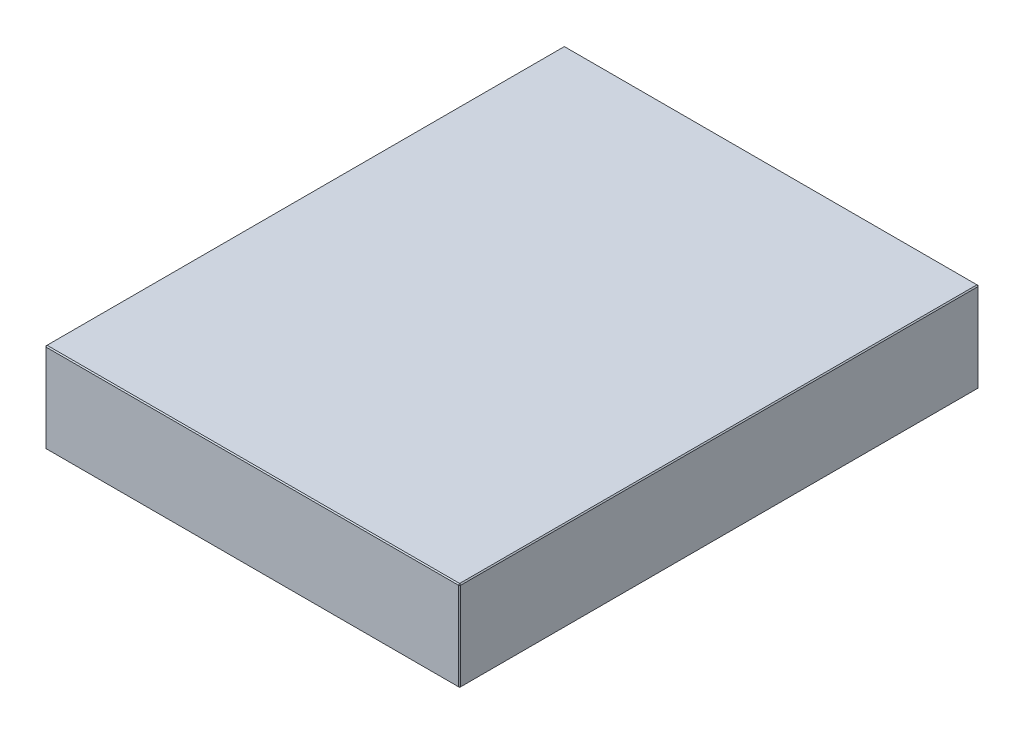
ISO-10303-21;
HEADER;
FILE_DESCRIPTION(('STEP AP214'),'2;1');
FILE_NAME('part.step','',(''),(''),'','','');
FILE_SCHEMA(('AUTOMOTIVE_DESIGN { 1 0 10303 214 1 1 1 1 }'));
ENDSEC;
DATA;
#1=APPLICATION_CONTEXT('core data for automotive mechanical design processes');
#2=APPLICATION_PROTOCOL_DEFINITION('international standard','automotive_design',2000,#1);
#3=PRODUCT_CONTEXT('',#1,'mechanical');
#4=PRODUCT('Part','Part','',(#3));
#5=PRODUCT_RELATED_PRODUCT_CATEGORY('part','',(#4));
#6=PRODUCT_DEFINITION_FORMATION('','',#4);
#7=PRODUCT_DEFINITION_CONTEXT('part definition',#1,'design');
#8=PRODUCT_DEFINITION('design','',#6,#7);
#9=PRODUCT_DEFINITION_SHAPE('','',#8);
#10=(LENGTH_UNIT() NAMED_UNIT(*) SI_UNIT(.MILLI.,.METRE.));
#11=(NAMED_UNIT(*) PLANE_ANGLE_UNIT() SI_UNIT($,.RADIAN.));
#12=(NAMED_UNIT(*) SI_UNIT($,.STERADIAN.) SOLID_ANGLE_UNIT());
#13=UNCERTAINTY_MEASURE_WITH_UNIT(LENGTH_MEASURE(1.E-05),#10,'distance_accuracy_value','');
#14=(GEOMETRIC_REPRESENTATION_CONTEXT(3) GLOBAL_UNCERTAINTY_ASSIGNED_CONTEXT((#13)) GLOBAL_UNIT_ASSIGNED_CONTEXT((#10,
#11,#12)) REPRESENTATION_CONTEXT('',''));
#15=CARTESIAN_POINT('',(0.,0.,0.));
#16=DIRECTION('',(0.,0.,1.));
#17=DIRECTION('',(1.,0.,0.));
#18=AXIS2_PLACEMENT_3D('',#15,#16,#17);
#19=CARTESIAN_POINT('',(-198.,86.,248.));
#20=DIRECTION('',(1.,0.,0.));
#21=DIRECTION('',(0.,0.,-1.));
#22=AXIS2_PLACEMENT_3D('',#19,#20,#21);
#23=PLANE('',#22);
#24=DIRECTION('',(0.,-1.,0.));
#25=VECTOR('',#24,1.);
#26=CARTESIAN_POINT('',(-198.,86.,-247.));
#27=LINE('',#26,#25);
#28=CARTESIAN_POINT('',(-198.,85.,-247.));
#29=VERTEX_POINT('',#28);
#30=CARTESIAN_POINT('',(-198.,1.00000000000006,-247.));
#31=VERTEX_POINT('',#30);
#32=EDGE_CURVE('E114',#29,#31,#27,.T.);
#33=ORIENTED_EDGE('',*,*,#32,.T.);
#34=DIRECTION('',(0.,0.,1.));
#35=VECTOR('',#34,1.);
#36=CARTESIAN_POINT('',(-198.,1.00000000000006,248.));
#37=LINE('',#36,#35);
#38=CARTESIAN_POINT('',(-198.,1.00000000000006,247.));
#39=VERTEX_POINT('',#38);
#40=EDGE_CURVE('E110',#31,#39,#37,.T.);
#41=ORIENTED_EDGE('',*,*,#40,.T.);
#42=DIRECTION('',(0.,1.,0.));
#43=VECTOR('',#42,1.);
#44=CARTESIAN_POINT('',(-198.,86.,247.));
#45=LINE('',#44,#43);
#46=CARTESIAN_POINT('',(-198.,85.,247.));
#47=VERTEX_POINT('',#46);
#48=EDGE_CURVE('E103',#39,#47,#45,.T.);
#49=ORIENTED_EDGE('',*,*,#48,.T.);
#50=DIRECTION('',(0.,0.,-1.));
#51=VECTOR('',#50,1.);
#52=CARTESIAN_POINT('',(-198.,85.,-248.));
#53=LINE('',#52,#51);
#54=EDGE_CURVE('E107',#47,#29,#53,.T.);
#55=ORIENTED_EDGE('',*,*,#54,.T.);
#56=EDGE_LOOP('',(#33,#41,#49,#55));
#57=FACE_BOUND('',#56,.T.);
#58=ADVANCED_FACE('F15',(#57),#23,.F.);
#59=CARTESIAN_POINT('',(198.,86.,248.));
#60=DIRECTION('',(0.,0.,-1.));
#61=DIRECTION('',(-1.,0.,0.));
#62=AXIS2_PLACEMENT_3D('',#59,#60,#61);
#63=PLANE('',#62);
#64=DIRECTION('',(-1.,0.,0.));
#65=VECTOR('',#64,1.);
#66=CARTESIAN_POINT('',(-198.,85.,248.));
#67=LINE('',#66,#65);
#68=CARTESIAN_POINT('',(197.,85.,248.));
#69=VERTEX_POINT('',#68);
#70=CARTESIAN_POINT('',(-197.,85.,248.));
#71=VERTEX_POINT('',#70);
#72=EDGE_CURVE('E164',#69,#71,#67,.T.);
#73=ORIENTED_EDGE('',*,*,#72,.T.);
#74=DIRECTION('',(0.,-1.,0.));
#75=VECTOR('',#74,1.);
#76=CARTESIAN_POINT('',(-197.,86.,248.));
#77=LINE('',#76,#75);
#78=CARTESIAN_POINT('',(-197.,1.,248.));
#79=VERTEX_POINT('',#78);
#80=EDGE_CURVE('E122',#71,#79,#77,.T.);
#81=ORIENTED_EDGE('',*,*,#80,.T.);
#82=DIRECTION('',(1.,0.,0.));
#83=VECTOR('',#82,1.);
#84=CARTESIAN_POINT('',(198.,1.,248.));
#85=LINE('',#84,#83);
#86=CARTESIAN_POINT('',(197.,1.,248.));
#87=VERTEX_POINT('',#86);
#88=EDGE_CURVE('E168',#79,#87,#85,.T.);
#89=ORIENTED_EDGE('',*,*,#88,.T.);
#90=DIRECTION('',(0.,1.,0.));
#91=VECTOR('',#90,1.);
#92=CARTESIAN_POINT('',(197.,86.,248.));
#93=LINE('',#92,#91);
#94=EDGE_CURVE('E166',#87,#69,#93,.T.);
#95=ORIENTED_EDGE('',*,*,#94,.T.);
#96=EDGE_LOOP('',(#73,#81,#89,#95));
#97=FACE_BOUND('',#96,.T.);
#98=ADVANCED_FACE('F275',(#97),#63,.F.);
#99=CARTESIAN_POINT('',(198.,86.,248.));
#100=DIRECTION('',(-1.,0.,0.));
#101=DIRECTION('',(0.,0.,1.));
#102=AXIS2_PLACEMENT_3D('',#99,#100,#101);
#103=PLANE('',#102);
#104=DIRECTION('',(0.,0.,-1.));
#105=VECTOR('',#104,1.);
#106=CARTESIAN_POINT('',(198.,1.,248.));
#107=LINE('',#106,#105);
#108=CARTESIAN_POINT('',(198.,1.,247.));
#109=VERTEX_POINT('',#108);
#110=CARTESIAN_POINT('',(198.,1.,-247.));
#111=VERTEX_POINT('',#110);
#112=EDGE_CURVE('E159',#109,#111,#107,.T.);
#113=ORIENTED_EDGE('',*,*,#112,.T.);
#114=DIRECTION('',(0.,1.,0.));
#115=VECTOR('',#114,1.);
#116=CARTESIAN_POINT('',(198.,86.,-247.));
#117=LINE('',#116,#115);
#118=CARTESIAN_POINT('',(198.,85.,-247.));
#119=VERTEX_POINT('',#118);
#120=EDGE_CURVE('E161',#111,#119,#117,.T.);
#121=ORIENTED_EDGE('',*,*,#120,.T.);
#122=DIRECTION('',(0.,0.,1.));
#123=VECTOR('',#122,1.);
#124=CARTESIAN_POINT('',(198.,85.,248.));
#125=LINE('',#124,#123);
#126=CARTESIAN_POINT('',(198.,85.,247.));
#127=VERTEX_POINT('',#126);
#128=EDGE_CURVE('E155',#119,#127,#125,.T.);
#129=ORIENTED_EDGE('',*,*,#128,.T.);
#130=DIRECTION('',(0.,-1.,0.));
#131=VECTOR('',#130,1.);
#132=CARTESIAN_POINT('',(198.,86.,247.));
#133=LINE('',#132,#131);
#134=EDGE_CURVE('E157',#127,#109,#133,.T.);
#135=ORIENTED_EDGE('',*,*,#134,.T.);
#136=EDGE_LOOP('',(#113,#121,#129,#135));
#137=FACE_BOUND('',#136,.T.);
#138=ADVANCED_FACE('F254',(#137),#103,.F.);
#139=CARTESIAN_POINT('',(198.,86.,-248.));
#140=DIRECTION('',(0.,0.,1.));
#141=DIRECTION('',(1.,0.,0.));
#142=AXIS2_PLACEMENT_3D('',#139,#140,#141);
#143=PLANE('',#142);
#144=DIRECTION('',(0.,-1.,0.));
#145=VECTOR('',#144,1.);
#146=CARTESIAN_POINT('',(197.,86.,-248.));
#147=LINE('',#146,#145);
#148=CARTESIAN_POINT('',(197.,85.,-248.));
#149=VERTEX_POINT('',#148);
#150=CARTESIAN_POINT('',(197.,1.,-248.));
#151=VERTEX_POINT('',#150);
#152=EDGE_CURVE('E148',#149,#151,#147,.T.);
#153=ORIENTED_EDGE('',*,*,#152,.T.);
#154=DIRECTION('',(-1.,0.,0.));
#155=VECTOR('',#154,1.);
#156=CARTESIAN_POINT('',(198.,1.,-248.));
#157=LINE('',#156,#155);
#158=CARTESIAN_POINT('',(-197.,1.,-248.));
#159=VERTEX_POINT('',#158);
#160=EDGE_CURVE('E153',#151,#159,#157,.T.);
#161=ORIENTED_EDGE('',*,*,#160,.T.);
#162=DIRECTION('',(0.,1.,0.));
#163=VECTOR('',#162,1.);
#164=CARTESIAN_POINT('',(-197.,86.,-248.));
#165=LINE('',#164,#163);
#166=CARTESIAN_POINT('',(-197.,85.,-248.));
#167=VERTEX_POINT('',#166);
#168=EDGE_CURVE('E150',#159,#167,#165,.T.);
#169=ORIENTED_EDGE('',*,*,#168,.T.);
#170=DIRECTION('',(1.,0.,0.));
#171=VECTOR('',#170,1.);
#172=CARTESIAN_POINT('',(198.,85.,-248.));
#173=LINE('',#172,#171);
#174=EDGE_CURVE('E146',#167,#149,#173,.T.);
#175=ORIENTED_EDGE('',*,*,#174,.T.);
#176=EDGE_LOOP('',(#153,#161,#169,#175));
#177=FACE_BOUND('',#176,.T.);
#178=ADVANCED_FACE('F284',(#177),#143,.F.);
#179=CARTESIAN_POINT('',(0.,86.,0.));
#180=DIRECTION('',(0.,1.,0.));
#181=DIRECTION('',(0.,0.,1.));
#182=AXIS2_PLACEMENT_3D('',#179,#180,#181);
#183=PLANE('',#182);
#184=DIRECTION('',(0.,0.,-1.));
#185=VECTOR('',#184,1.);
#186=CARTESIAN_POINT('',(197.,86.,-248.));
#187=LINE('',#186,#185);
#188=CARTESIAN_POINT('',(197.,86.,247.));
#189=VERTEX_POINT('',#188);
#190=CARTESIAN_POINT('',(197.,86.,-247.));
#191=VERTEX_POINT('',#190);
#192=EDGE_CURVE('E24',#189,#191,#187,.T.);
#193=ORIENTED_EDGE('',*,*,#192,.T.);
#194=DIRECTION('',(-1.,0.,0.));
#195=VECTOR('',#194,1.);
#196=CARTESIAN_POINT('',(-198.,86.,-247.));
#197=LINE('',#196,#195);
#198=CARTESIAN_POINT('',(-197.,86.,-247.));
#199=VERTEX_POINT('',#198);
#200=EDGE_CURVE('E9',#191,#199,#197,.T.);
#201=ORIENTED_EDGE('',*,*,#200,.T.);
#202=DIRECTION('',(0.,0.,1.));
#203=VECTOR('',#202,1.);
#204=CARTESIAN_POINT('',(-197.,86.,248.));
#205=LINE('',#204,#203);
#206=CARTESIAN_POINT('',(-197.,86.,247.));
#207=VERTEX_POINT('',#206);
#208=EDGE_CURVE('E180',#199,#207,#205,.T.);
#209=ORIENTED_EDGE('',*,*,#208,.T.);
#210=DIRECTION('',(1.,0.,0.));
#211=VECTOR('',#210,1.);
#212=CARTESIAN_POINT('',(198.,86.,247.));
#213=LINE('',#212,#211);
#214=EDGE_CURVE('E35',#207,#189,#213,.T.);
#215=ORIENTED_EDGE('',*,*,#214,.T.);
#216=EDGE_LOOP('',(#193,#201,#209,#215));
#217=FACE_BOUND('',#216,.T.);
#218=ADVANCED_FACE('F350',(#217),#183,.T.);
#219=CARTESIAN_POINT('',(0.,0.,0.));
#220=DIRECTION('',(0.,1.,0.));
#221=DIRECTION('',(0.,0.,1.));
#222=AXIS2_PLACEMENT_3D('',#219,#220,#221);
#223=PLANE('',#222);
#224=DIRECTION('',(0.,0.,1.));
#225=VECTOR('',#224,1.);
#226=CARTESIAN_POINT('',(197.,0.,0.));
#227=LINE('',#226,#225);
#228=CARTESIAN_POINT('',(197.,0.,-247.));
#229=VERTEX_POINT('',#228);
#230=CARTESIAN_POINT('',(197.,0.,247.));
#231=VERTEX_POINT('',#230);
#232=EDGE_CURVE('E171',#229,#231,#227,.T.);
#233=ORIENTED_EDGE('',*,*,#232,.T.);
#234=DIRECTION('',(-1.,0.,0.));
#235=VECTOR('',#234,1.);
#236=CARTESIAN_POINT('',(0.,0.,247.));
#237=LINE('',#236,#235);
#238=CARTESIAN_POINT('',(-197.,0.,247.));
#239=VERTEX_POINT('',#238);
#240=EDGE_CURVE('E177',#231,#239,#237,.T.);
#241=ORIENTED_EDGE('',*,*,#240,.T.);
#242=DIRECTION('',(0.,0.,-1.));
#243=VECTOR('',#242,1.);
#244=CARTESIAN_POINT('',(-197.,0.,0.));
#245=LINE('',#244,#243);
#246=CARTESIAN_POINT('',(-197.,0.,-247.));
#247=VERTEX_POINT('',#246);
#248=EDGE_CURVE('E175',#239,#247,#245,.T.);
#249=ORIENTED_EDGE('',*,*,#248,.T.);
#250=DIRECTION('',(1.,0.,0.));
#251=VECTOR('',#250,1.);
#252=CARTESIAN_POINT('',(0.,0.,-247.));
#253=LINE('',#252,#251);
#254=EDGE_CURVE('E173',#247,#229,#253,.T.);
#255=ORIENTED_EDGE('',*,*,#254,.T.);
#256=EDGE_LOOP('',(#233,#241,#249,#255));
#257=FACE_BOUND('',#256,.T.);
#258=ADVANCED_FACE('F246',(#257),#223,.F.);
#259=CARTESIAN_POINT('',(198.,86.,247.));
#260=DIRECTION('',(-0.707106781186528,0.,-0.707106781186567));
#261=DIRECTION('',(0.,-1.,0.));
#262=AXIS2_PLACEMENT_3D('',#259,#260,#261);
#263=PLANE('',#262);
#264=DIRECTION('',(-0.707106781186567,0.,0.707106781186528));
#265=VECTOR('',#264,1.);
#266=CARTESIAN_POINT('',(197.,85.,248.));
#267=LINE('',#266,#265);
#268=EDGE_CURVE('E19',#69,#127,#267,.F.);
#269=ORIENTED_EDGE('',*,*,#268,.F.);
#270=ORIENTED_EDGE('',*,*,#94,.F.);
#271=DIRECTION('',(0.707106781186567,0.,-0.707106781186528));
#272=VECTOR('',#271,1.);
#273=CARTESIAN_POINT('',(197.,1.,248.));
#274=LINE('',#273,#272);
#275=EDGE_CURVE('E142',#109,#87,#274,.F.);
#276=ORIENTED_EDGE('',*,*,#275,.F.);
#277=ORIENTED_EDGE('',*,*,#134,.F.);
#278=EDGE_LOOP('',(#269,#270,#276,#277));
#279=FACE_BOUND('',#278,.T.);
#280=ADVANCED_FACE('F17',(#279),#263,.F.);
#281=CARTESIAN_POINT('',(197.,85.,248.));
#282=DIRECTION('',(0.577350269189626,0.577350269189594,0.577350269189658));
#283=DIRECTION('',(0.707106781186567,0.,-0.707106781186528));
#284=AXIS2_PLACEMENT_3D('',#281,#282,#283);
#285=PLANE('',#284);
#286=DIRECTION('',(0.,-0.707106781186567,0.707106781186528));
#287=VECTOR('',#286,1.);
#288=CARTESIAN_POINT('',(197.,85.,248.));
#289=LINE('',#288,#287);
#290=EDGE_CURVE('E226',#69,#189,#289,.F.);
#291=ORIENTED_EDGE('',*,*,#290,.F.);
#292=ORIENTED_EDGE('',*,*,#268,.T.);
#293=DIRECTION('',(-0.707106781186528,0.707106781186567,0.));
#294=VECTOR('',#293,1.);
#295=CARTESIAN_POINT('',(197.5,85.5,247.));
#296=LINE('',#295,#294);
#297=EDGE_CURVE('E228',#189,#127,#296,.F.);
#298=ORIENTED_EDGE('',*,*,#297,.F.);
#299=EDGE_LOOP('',(#291,#292,#298));
#300=FACE_BOUND('',#299,.T.);
#301=ADVANCED_FACE('F270',(#300),#285,.T.);
#302=CARTESIAN_POINT('',(197.,1.,248.));
#303=DIRECTION('',(0.577350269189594,-0.577350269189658,0.577350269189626));
#304=DIRECTION('',(0.,-0.707106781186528,-0.707106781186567));
#305=AXIS2_PLACEMENT_3D('',#302,#303,#304);
#306=PLANE('',#305);
#307=DIRECTION('',(-0.707106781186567,-0.707106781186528,0.));
#308=VECTOR('',#307,1.);
#309=CARTESIAN_POINT('',(197.5,0.5,247.));
#310=LINE('',#309,#308);
#311=EDGE_CURVE('E220',#109,#231,#310,.T.);
#312=ORIENTED_EDGE('',*,*,#311,.F.);
#313=ORIENTED_EDGE('',*,*,#275,.T.);
#314=DIRECTION('',(0.,0.707106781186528,0.707106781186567));
#315=VECTOR('',#314,1.);
#316=CARTESIAN_POINT('',(197.,1.,248.));
#317=LINE('',#316,#315);
#318=EDGE_CURVE('E223',#231,#87,#317,.T.);
#319=ORIENTED_EDGE('',*,*,#318,.F.);
#320=EDGE_LOOP('',(#312,#313,#319));
#321=FACE_BOUND('',#320,.T.);
#322=ADVANCED_FACE('F235',(#321),#306,.T.);
#323=CARTESIAN_POINT('',(197.,86.,0.));
#324=DIRECTION('',(0.707106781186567,0.707106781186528,0.));
#325=DIRECTION('',(0.,0.,1.));
#326=AXIS2_PLACEMENT_3D('',#323,#324,#325);
#327=PLANE('',#326);
#328=ORIENTED_EDGE('',*,*,#297,.T.);
#329=ORIENTED_EDGE('',*,*,#128,.F.);
#330=DIRECTION('',(0.707106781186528,-0.707106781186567,0.));
#331=VECTOR('',#330,1.);
#332=CARTESIAN_POINT('',(198.,85.,-247.));
#333=LINE('',#332,#331);
#334=EDGE_CURVE('E215',#191,#119,#333,.T.);
#335=ORIENTED_EDGE('',*,*,#334,.F.);
#336=ORIENTED_EDGE('',*,*,#192,.F.);
#337=EDGE_LOOP('',(#328,#329,#335,#336));
#338=FACE_BOUND('',#337,.T.);
#339=ADVANCED_FACE('F265',(#338),#327,.T.);
#340=CARTESIAN_POINT('',(0.,86.,247.));
#341=DIRECTION('',(0.,0.707106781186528,0.707106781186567));
#342=DIRECTION('',(-1.,0.,0.));
#343=AXIS2_PLACEMENT_3D('',#340,#341,#342);
#344=PLANE('',#343);
#345=ORIENTED_EDGE('',*,*,#290,.T.);
#346=ORIENTED_EDGE('',*,*,#214,.F.);
#347=DIRECTION('',(0.,0.707106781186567,-0.707106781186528));
#348=VECTOR('',#347,1.);
#349=CARTESIAN_POINT('',(-197.,85.5,247.5));
#350=LINE('',#349,#348);
#351=EDGE_CURVE('E126',#71,#207,#350,.T.);
#352=ORIENTED_EDGE('',*,*,#351,.F.);
#353=ORIENTED_EDGE('',*,*,#72,.F.);
#354=EDGE_LOOP('',(#345,#346,#352,#353));
#355=FACE_BOUND('',#354,.T.);
#356=ADVANCED_FACE('F273',(#355),#344,.T.);
#357=CARTESIAN_POINT('',(-197.,86.,248.));
#358=DIRECTION('',(0.707106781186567,0.,-0.707106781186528));
#359=DIRECTION('',(0.,-1.,0.));
#360=AXIS2_PLACEMENT_3D('',#357,#358,#359);
#361=PLANE('',#360);
#362=DIRECTION('',(0.707106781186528,0.,0.707106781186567));
#363=VECTOR('',#362,1.);
#364=CARTESIAN_POINT('',(-197.,1.,248.));
#365=LINE('',#364,#363);
#366=EDGE_CURVE('E127',#79,#39,#365,.F.);
#367=ORIENTED_EDGE('',*,*,#366,.F.);
#368=ORIENTED_EDGE('',*,*,#80,.F.);
#369=DIRECTION('',(-0.707106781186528,0.,-0.707106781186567));
#370=VECTOR('',#369,1.);
#371=CARTESIAN_POINT('',(-198.,85.,247.));
#372=LINE('',#371,#370);
#373=EDGE_CURVE('E118',#47,#71,#372,.F.);
#374=ORIENTED_EDGE('',*,*,#373,.F.);
#375=ORIENTED_EDGE('',*,*,#48,.F.);
#376=EDGE_LOOP('',(#367,#368,#374,#375));
#377=FACE_BOUND('',#376,.T.);
#378=ADVANCED_FACE('F120',(#377),#361,.F.);
#379=CARTESIAN_POINT('',(198.,1.,248.));
#380=DIRECTION('',(0.,0.707106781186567,-0.707106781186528));
#381=DIRECTION('',(1.,0.,0.));
#382=AXIS2_PLACEMENT_3D('',#379,#380,#381);
#383=PLANE('',#382);
#384=ORIENTED_EDGE('',*,*,#318,.T.);
#385=ORIENTED_EDGE('',*,*,#88,.F.);
#386=DIRECTION('',(0.,-0.707106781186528,-0.707106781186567));
#387=VECTOR('',#386,1.);
#388=CARTESIAN_POINT('',(-197.,1.,248.));
#389=LINE('',#388,#387);
#390=EDGE_CURVE('E211',#239,#79,#389,.F.);
#391=ORIENTED_EDGE('',*,*,#390,.F.);
#392=ORIENTED_EDGE('',*,*,#240,.F.);
#393=EDGE_LOOP('',(#384,#385,#391,#392));
#394=FACE_BOUND('',#393,.T.);
#395=ADVANCED_FACE('F243',(#394),#383,.F.);
#396=CARTESIAN_POINT('',(198.,1.,248.));
#397=DIRECTION('',(-0.707106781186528,0.707106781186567,0.));
#398=DIRECTION('',(0.,0.,-1.));
#399=AXIS2_PLACEMENT_3D('',#396,#397,#398);
#400=PLANE('',#399);
#401=ORIENTED_EDGE('',*,*,#311,.T.);
#402=ORIENTED_EDGE('',*,*,#232,.F.);
#403=DIRECTION('',(0.707106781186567,0.707106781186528,0.));
#404=VECTOR('',#403,1.);
#405=CARTESIAN_POINT('',(197.5,0.499999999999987,-247.));
#406=LINE('',#405,#404);
#407=EDGE_CURVE('E208',#111,#229,#406,.F.);
#408=ORIENTED_EDGE('',*,*,#407,.F.);
#409=ORIENTED_EDGE('',*,*,#112,.F.);
#410=EDGE_LOOP('',(#401,#402,#408,#409));
#411=FACE_BOUND('',#410,.T.);
#412=ADVANCED_FACE('F251',(#411),#400,.F.);
#413=CARTESIAN_POINT('',(197.,86.,-248.));
#414=DIRECTION('',(-0.707106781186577,0.,0.707106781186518));
#415=DIRECTION('',(0.,-1.,0.));
#416=AXIS2_PLACEMENT_3D('',#413,#414,#415);
#417=PLANE('',#416);
#418=DIRECTION('',(0.707106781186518,0.,0.707106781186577));
#419=VECTOR('',#418,1.);
#420=CARTESIAN_POINT('',(198.,85.,-247.));
#421=LINE('',#420,#419);
#422=EDGE_CURVE('E217',#119,#149,#421,.F.);
#423=ORIENTED_EDGE('',*,*,#422,.F.);
#424=ORIENTED_EDGE('',*,*,#120,.F.);
#425=DIRECTION('',(-0.707106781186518,0.,-0.707106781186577));
#426=VECTOR('',#425,1.);
#427=CARTESIAN_POINT('',(197.,1.,-248.));
#428=LINE('',#427,#426);
#429=EDGE_CURVE('E205',#151,#111,#428,.F.);
#430=ORIENTED_EDGE('',*,*,#429,.F.);
#431=ORIENTED_EDGE('',*,*,#152,.F.);
#432=EDGE_LOOP('',(#423,#424,#430,#431));
#433=FACE_BOUND('',#432,.T.);
#434=ADVANCED_FACE('F258',(#433),#417,.F.);
#435=CARTESIAN_POINT('',(198.,85.,-247.));
#436=DIRECTION('',(0.577350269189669,0.577350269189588,-0.57735026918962));
#437=DIRECTION('',(-0.707106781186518,0.,-0.707106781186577));
#438=AXIS2_PLACEMENT_3D('',#435,#436,#437);
#439=PLANE('',#438);
#440=ORIENTED_EDGE('',*,*,#334,.T.);
#441=ORIENTED_EDGE('',*,*,#422,.T.);
#442=DIRECTION('',(0.,0.707106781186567,0.707106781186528));
#443=VECTOR('',#442,1.);
#444=CARTESIAN_POINT('',(197.,85.5,-247.5));
#445=LINE('',#444,#443);
#446=EDGE_CURVE('E134',#191,#149,#445,.F.);
#447=ORIENTED_EDGE('',*,*,#446,.F.);
#448=EDGE_LOOP('',(#440,#441,#447));
#449=FACE_BOUND('',#448,.T.);
#450=ADVANCED_FACE('F325',(#449),#439,.T.);
#451=CARTESIAN_POINT('',(-198.,85.,247.));
#452=DIRECTION('',(-0.577350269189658,0.577350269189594,0.577350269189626));
#453=DIRECTION('',(0.707106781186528,0.,0.707106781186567));
#454=AXIS2_PLACEMENT_3D('',#451,#452,#453);
#455=PLANE('',#454);
#456=ORIENTED_EDGE('',*,*,#373,.T.);
#457=ORIENTED_EDGE('',*,*,#351,.T.);
#458=DIRECTION('',(-0.707106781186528,-0.707106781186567,0.));
#459=VECTOR('',#458,1.);
#460=CARTESIAN_POINT('',(-198.,85.,247.));
#461=LINE('',#460,#459);
#462=EDGE_CURVE('E130',#47,#207,#461,.F.);
#463=ORIENTED_EDGE('',*,*,#462,.F.);
#464=EDGE_LOOP('',(#456,#457,#463));
#465=FACE_BOUND('',#464,.T.);
#466=ADVANCED_FACE('F131',(#465),#455,.T.);
#467=CARTESIAN_POINT('',(-197.,1.,248.));
#468=DIRECTION('',(-0.577350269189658,-0.577350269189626,0.577350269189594));
#469=DIRECTION('',(0.707106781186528,-0.707106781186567,0.));
#470=AXIS2_PLACEMENT_3D('',#467,#468,#469);
#471=PLANE('',#470);
#472=ORIENTED_EDGE('',*,*,#390,.T.);
#473=ORIENTED_EDGE('',*,*,#366,.T.);
#474=DIRECTION('',(-0.707106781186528,0.707106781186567,0.));
#475=VECTOR('',#474,1.);
#476=CARTESIAN_POINT('',(-197.5,0.500000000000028,247.));
#477=LINE('',#476,#475);
#478=EDGE_CURVE('E135',#239,#39,#477,.T.);
#479=ORIENTED_EDGE('',*,*,#478,.F.);
#480=EDGE_LOOP('',(#472,#473,#479));
#481=FACE_BOUND('',#480,.T.);
#482=ADVANCED_FACE('F318',(#481),#471,.T.);
#483=CARTESIAN_POINT('',(197.,1.,-248.));
#484=DIRECTION('',(0.577350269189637,-0.577350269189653,-0.577350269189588));
#485=DIRECTION('',(0.707106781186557,0.707106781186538,0.));
#486=AXIS2_PLACEMENT_3D('',#483,#484,#485);
#487=PLANE('',#486);
#488=ORIENTED_EDGE('',*,*,#429,.T.);
#489=ORIENTED_EDGE('',*,*,#407,.T.);
#490=DIRECTION('',(0.,-0.707106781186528,0.707106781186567));
#491=VECTOR('',#490,1.);
#492=CARTESIAN_POINT('',(197.,1.,-248.));
#493=LINE('',#492,#491);
#494=EDGE_CURVE('E198',#151,#229,#493,.T.);
#495=ORIENTED_EDGE('',*,*,#494,.F.);
#496=EDGE_LOOP('',(#488,#489,#495));
#497=FACE_BOUND('',#496,.T.);
#498=ADVANCED_FACE('F314',(#497),#487,.T.);
#499=CARTESIAN_POINT('',(0.,86.,-247.));
#500=DIRECTION('',(0.,0.707106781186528,-0.707106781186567));
#501=DIRECTION('',(1.,0.,0.));
#502=AXIS2_PLACEMENT_3D('',#499,#500,#501);
#503=PLANE('',#502);
#504=ORIENTED_EDGE('',*,*,#446,.T.);
#505=ORIENTED_EDGE('',*,*,#174,.F.);
#506=DIRECTION('',(0.,-0.707106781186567,-0.707106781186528));
#507=VECTOR('',#506,1.);
#508=CARTESIAN_POINT('',(-197.,85.,-248.));
#509=LINE('',#508,#507);
#510=EDGE_CURVE('E195',#199,#167,#509,.T.);
#511=ORIENTED_EDGE('',*,*,#510,.F.);
#512=ORIENTED_EDGE('',*,*,#200,.F.);
#513=EDGE_LOOP('',(#504,#505,#511,#512));
#514=FACE_BOUND('',#513,.T.);
#515=ADVANCED_FACE('F311',(#514),#503,.T.);
#516=CARTESIAN_POINT('',(-197.,86.,0.));
#517=DIRECTION('',(-0.707106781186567,0.707106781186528,0.));
#518=DIRECTION('',(0.,0.,-1.));
#519=AXIS2_PLACEMENT_3D('',#516,#517,#518);
#520=PLANE('',#519);
#521=ORIENTED_EDGE('',*,*,#462,.T.);
#522=ORIENTED_EDGE('',*,*,#208,.F.);
#523=DIRECTION('',(0.707106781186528,0.707106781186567,0.));
#524=VECTOR('',#523,1.);
#525=CARTESIAN_POINT('',(-197.5,85.5,-247.));
#526=LINE('',#525,#524);
#527=EDGE_CURVE('E138',#29,#199,#526,.T.);
#528=ORIENTED_EDGE('',*,*,#527,.F.);
#529=ORIENTED_EDGE('',*,*,#54,.F.);
#530=EDGE_LOOP('',(#521,#522,#528,#529));
#531=FACE_BOUND('',#530,.T.);
#532=ADVANCED_FACE('F137',(#531),#520,.T.);
#533=CARTESIAN_POINT('',(-198.,1.00000000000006,248.));
#534=DIRECTION('',(0.707106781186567,0.707106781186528,0.));
#535=DIRECTION('',(0.,0.,1.));
#536=AXIS2_PLACEMENT_3D('',#533,#534,#535);
#537=PLANE('',#536);
#538=ORIENTED_EDGE('',*,*,#478,.T.);
#539=ORIENTED_EDGE('',*,*,#40,.F.);
#540=DIRECTION('',(0.707106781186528,-0.707106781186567,0.));
#541=VECTOR('',#540,1.);
#542=CARTESIAN_POINT('',(-198.,1.00000000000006,-247.));
#543=LINE('',#542,#541);
#544=EDGE_CURVE('E191',#247,#31,#543,.F.);
#545=ORIENTED_EDGE('',*,*,#544,.F.);
#546=ORIENTED_EDGE('',*,*,#248,.F.);
#547=EDGE_LOOP('',(#538,#539,#545,#546));
#548=FACE_BOUND('',#547,.T.);
#549=ADVANCED_FACE('F304',(#548),#537,.F.);
#550=CARTESIAN_POINT('',(198.,1.,-248.));
#551=DIRECTION('',(0.,0.707106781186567,0.707106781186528));
#552=DIRECTION('',(-1.,0.,0.));
#553=AXIS2_PLACEMENT_3D('',#550,#551,#552);
#554=PLANE('',#553);
#555=ORIENTED_EDGE('',*,*,#494,.T.);
#556=ORIENTED_EDGE('',*,*,#254,.F.);
#557=DIRECTION('',(0.,0.707106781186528,-0.707106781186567));
#558=VECTOR('',#557,1.);
#559=CARTESIAN_POINT('',(-197.,0.500000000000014,-247.5));
#560=LINE('',#559,#558);
#561=EDGE_CURVE('E188',#159,#247,#560,.F.);
#562=ORIENTED_EDGE('',*,*,#561,.F.);
#563=ORIENTED_EDGE('',*,*,#160,.F.);
#564=EDGE_LOOP('',(#555,#556,#562,#563));
#565=FACE_BOUND('',#564,.T.);
#566=ADVANCED_FACE('F300',(#565),#554,.F.);
#567=CARTESIAN_POINT('',(-197.,85.,-248.));
#568=DIRECTION('',(-0.577350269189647,0.577350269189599,-0.577350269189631));
#569=DIRECTION('',(-0.707106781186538,0.,0.707106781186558));
#570=AXIS2_PLACEMENT_3D('',#567,#568,#569);
#571=PLANE('',#570);
#572=ORIENTED_EDGE('',*,*,#527,.T.);
#573=ORIENTED_EDGE('',*,*,#510,.T.);
#574=DIRECTION('',(0.707106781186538,0.,-0.707106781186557));
#575=VECTOR('',#574,1.);
#576=CARTESIAN_POINT('',(-197.,85.,-248.));
#577=LINE('',#576,#575);
#578=EDGE_CURVE('E186',#29,#167,#577,.T.);
#579=ORIENTED_EDGE('',*,*,#578,.F.);
#580=EDGE_LOOP('',(#572,#573,#579));
#581=FACE_BOUND('',#580,.T.);
#582=ADVANCED_FACE('F296',(#581),#571,.T.);
#583=CARTESIAN_POINT('',(-198.,1.00000000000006,-247.));
#584=DIRECTION('',(-0.577350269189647,-0.577350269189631,-0.577350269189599));
#585=DIRECTION('',(0.707106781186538,-0.707106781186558,0.));
#586=AXIS2_PLACEMENT_3D('',#583,#584,#585);
#587=PLANE('',#586);
#588=ORIENTED_EDGE('',*,*,#561,.T.);
#589=ORIENTED_EDGE('',*,*,#544,.T.);
#590=DIRECTION('',(-0.707106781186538,0.,0.707106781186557));
#591=VECTOR('',#590,1.);
#592=CARTESIAN_POINT('',(-198.,1.00000000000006,-247.));
#593=LINE('',#592,#591);
#594=EDGE_CURVE('E184',#159,#31,#593,.T.);
#595=ORIENTED_EDGE('',*,*,#594,.F.);
#596=EDGE_LOOP('',(#588,#589,#595));
#597=FACE_BOUND('',#596,.T.);
#598=ADVANCED_FACE('F292',(#597),#587,.T.);
#599=CARTESIAN_POINT('',(-198.,86.,-247.));
#600=DIRECTION('',(0.707106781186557,0.,0.707106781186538));
#601=DIRECTION('',(0.,-1.,0.));
#602=AXIS2_PLACEMENT_3D('',#599,#600,#601);
#603=PLANE('',#602);
#604=ORIENTED_EDGE('',*,*,#578,.T.);
#605=ORIENTED_EDGE('',*,*,#168,.F.);
#606=ORIENTED_EDGE('',*,*,#594,.T.);
#607=ORIENTED_EDGE('',*,*,#32,.F.);
#608=EDGE_LOOP('',(#604,#605,#606,#607));
#609=FACE_BOUND('',#608,.T.);
#610=ADVANCED_FACE('F289',(#609),#603,.F.);
#611=CLOSED_SHELL('',(#58,#98,#138,#178,#218,#258,#280,#301,#322,#339,#356,#378,#395,#412,#434,
#450,#466,#482,#498,#515,#532,#549,#566,#582,#598,#610));
#612=MANIFOLD_SOLID_BREP('B1',#611);
#613=ADVANCED_BREP_SHAPE_REPRESENTATION('',(#18,#612),#14);
#614=SHAPE_DEFINITION_REPRESENTATION(#9,#613);
ENDSEC;
END-ISO-10303-21;
